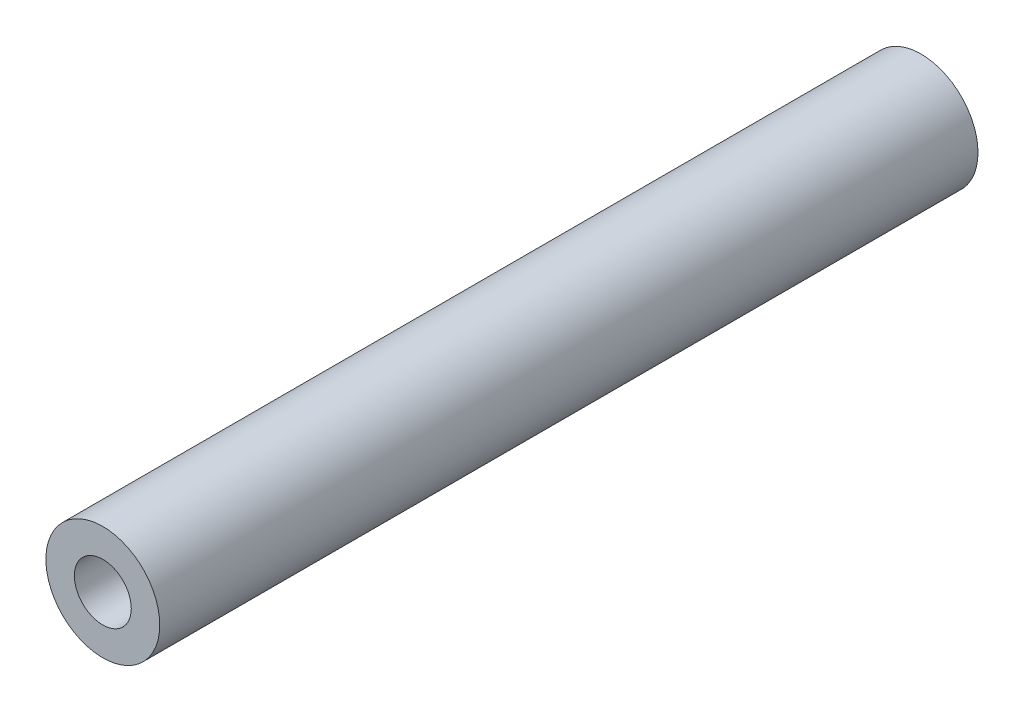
ISO-10303-21;
HEADER;
FILE_DESCRIPTION(('STEP AP214'),'2;1');
FILE_NAME('part.step','',(''),(''),'','','');
FILE_SCHEMA(('AUTOMOTIVE_DESIGN { 1 0 10303 214 1 1 1 1 }'));
ENDSEC;
DATA;
#1=APPLICATION_CONTEXT('core data for automotive mechanical design processes');
#2=APPLICATION_PROTOCOL_DEFINITION('international standard','automotive_design',2000,#1);
#3=PRODUCT_CONTEXT('',#1,'mechanical');
#4=PRODUCT('Part','Part','',(#3));
#5=PRODUCT_RELATED_PRODUCT_CATEGORY('part','',(#4));
#6=PRODUCT_DEFINITION_FORMATION('','',#4);
#7=PRODUCT_DEFINITION_CONTEXT('part definition',#1,'design');
#8=PRODUCT_DEFINITION('design','',#6,#7);
#9=PRODUCT_DEFINITION_SHAPE('','',#8);
#10=(LENGTH_UNIT() NAMED_UNIT(*) SI_UNIT(.MILLI.,.METRE.));
#11=(NAMED_UNIT(*) PLANE_ANGLE_UNIT() SI_UNIT($,.RADIAN.));
#12=(NAMED_UNIT(*) SI_UNIT($,.STERADIAN.) SOLID_ANGLE_UNIT());
#13=UNCERTAINTY_MEASURE_WITH_UNIT(LENGTH_MEASURE(1.E-05),#10,'distance_accuracy_value','');
#14=(GEOMETRIC_REPRESENTATION_CONTEXT(3) GLOBAL_UNCERTAINTY_ASSIGNED_CONTEXT((#13)) GLOBAL_UNIT_ASSIGNED_CONTEXT((#10,
#11,#12)) REPRESENTATION_CONTEXT('',''));
#15=CARTESIAN_POINT('',(0.,0.,0.));
#16=DIRECTION('',(0.,0.,1.));
#17=DIRECTION('',(1.,0.,0.));
#18=AXIS2_PLACEMENT_3D('',#15,#16,#17);
#19=CARTESIAN_POINT('',(0.,0.,115.));
#20=DIRECTION('',(0.,0.,1.));
#21=DIRECTION('',(1.,0.,0.));
#22=AXIS2_PLACEMENT_3D('',#19,#20,#21);
#23=PLANE('',#22);
#24=CARTESIAN_POINT('',(0.,0.,115.));
#25=DIRECTION('',(0.,0.,1.));
#26=DIRECTION('',(1.,0.,0.));
#27=AXIS2_PLACEMENT_3D('',#24,#25,#26);
#28=CIRCLE('',#27,8.);
#29=CARTESIAN_POINT('',(8.,0.,115.));
#30=VERTEX_POINT('',#29);
#31=EDGE_CURVE('E9',#30,#30,#28,.T.);
#32=ORIENTED_EDGE('',*,*,#31,.T.);
#33=EDGE_LOOP('',(#32));
#34=FACE_BOUND('',#33,.T.);
#35=CARTESIAN_POINT('',(0.,0.,115.));
#36=DIRECTION('',(0.,0.,1.));
#37=DIRECTION('',(1.,0.,0.));
#38=AXIS2_PLACEMENT_3D('',#35,#36,#37);
#39=CIRCLE('',#38,4.);
#40=CARTESIAN_POINT('',(4.,0.,115.));
#41=VERTEX_POINT('',#40);
#42=EDGE_CURVE('E25',#41,#41,#39,.T.);
#43=ORIENTED_EDGE('',*,*,#42,.F.);
#44=EDGE_LOOP('',(#43));
#45=FACE_BOUND('',#44,.T.);
#46=ADVANCED_FACE('F14',(#34,#45),#23,.T.);
#47=CARTESIAN_POINT('',(0.,0.,0.));
#48=DIRECTION('',(0.,0.,1.));
#49=DIRECTION('',(1.,0.,0.));
#50=AXIS2_PLACEMENT_3D('',#47,#48,#49);
#51=PLANE('',#50);
#52=CARTESIAN_POINT('',(0.,0.,0.));
#53=DIRECTION('',(0.,0.,1.));
#54=DIRECTION('',(1.,0.,0.));
#55=AXIS2_PLACEMENT_3D('',#52,#53,#54);
#56=CIRCLE('',#55,8.);
#57=CARTESIAN_POINT('',(8.,0.,0.));
#58=VERTEX_POINT('',#57);
#59=EDGE_CURVE('E18',#58,#58,#56,.T.);
#60=ORIENTED_EDGE('',*,*,#59,.F.);
#61=EDGE_LOOP('',(#60));
#62=FACE_BOUND('',#61,.T.);
#63=CARTESIAN_POINT('',(0.,0.,0.));
#64=DIRECTION('',(0.,0.,1.));
#65=DIRECTION('',(1.,0.,0.));
#66=AXIS2_PLACEMENT_3D('',#63,#64,#65);
#67=CIRCLE('',#66,4.);
#68=CARTESIAN_POINT('',(4.,0.,0.));
#69=VERTEX_POINT('',#68);
#70=EDGE_CURVE('E27',#69,#69,#67,.T.);
#71=ORIENTED_EDGE('',*,*,#70,.T.);
#72=EDGE_LOOP('',(#71));
#73=FACE_BOUND('',#72,.T.);
#74=ADVANCED_FACE('F37',(#62,#73),#51,.F.);
#75=CARTESIAN_POINT('',(0.,0.,115.));
#76=DIRECTION('',(0.,0.,-1.));
#77=DIRECTION('',(-1.,0.,0.));
#78=AXIS2_PLACEMENT_3D('',#75,#76,#77);
#79=CYLINDRICAL_SURFACE('',#78,8.);
#80=ORIENTED_EDGE('',*,*,#31,.F.);
#81=EDGE_LOOP('',(#80));
#82=FACE_BOUND('',#81,.T.);
#83=ORIENTED_EDGE('',*,*,#59,.T.);
#84=EDGE_LOOP('',(#83));
#85=FACE_BOUND('',#84,.T.);
#86=ADVANCED_FACE('F16',(#82,#85),#79,.T.);
#87=CARTESIAN_POINT('',(0.,0.,115.));
#88=DIRECTION('',(0.,0.,-1.));
#89=DIRECTION('',(-1.,0.,0.));
#90=AXIS2_PLACEMENT_3D('',#87,#88,#89);
#91=CYLINDRICAL_SURFACE('',#90,4.);
#92=ORIENTED_EDGE('',*,*,#42,.T.);
#93=EDGE_LOOP('',(#92));
#94=FACE_BOUND('',#93,.T.);
#95=ORIENTED_EDGE('',*,*,#70,.F.);
#96=EDGE_LOOP('',(#95));
#97=FACE_BOUND('',#96,.T.);
#98=ADVANCED_FACE('F33',(#94,#97),#91,.F.);
#99=CLOSED_SHELL('',(#46,#74,#86,#98));
#100=MANIFOLD_SOLID_BREP('B1',#99);
#101=ADVANCED_BREP_SHAPE_REPRESENTATION('',(#18,#100),#14);
#102=SHAPE_DEFINITION_REPRESENTATION(#9,#101);
ENDSEC;
END-ISO-10303-21;
